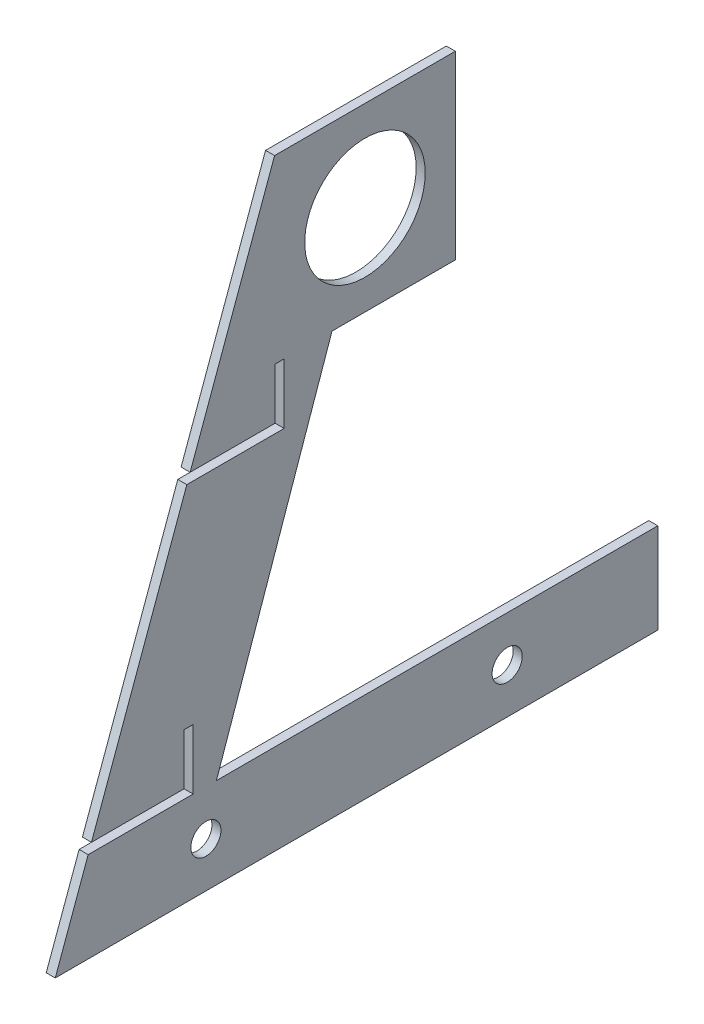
ISO-10303-21;
HEADER;
FILE_DESCRIPTION(('STEP AP214'),'2;1');
FILE_NAME('part.step','',(''),(''),'','','');
FILE_SCHEMA(('AUTOMOTIVE_DESIGN { 1 0 10303 214 1 1 1 1 }'));
ENDSEC;
DATA;
#1=APPLICATION_CONTEXT('core data for automotive mechanical design processes');
#2=APPLICATION_PROTOCOL_DEFINITION('international standard','automotive_design',2000,#1);
#3=PRODUCT_CONTEXT('',#1,'mechanical');
#4=PRODUCT('Part','Part','',(#3));
#5=PRODUCT_RELATED_PRODUCT_CATEGORY('part','',(#4));
#6=PRODUCT_DEFINITION_FORMATION('','',#4);
#7=PRODUCT_DEFINITION_CONTEXT('part definition',#1,'design');
#8=PRODUCT_DEFINITION('design','',#6,#7);
#9=PRODUCT_DEFINITION_SHAPE('','',#8);
#10=(LENGTH_UNIT() NAMED_UNIT(*) SI_UNIT(.MILLI.,.METRE.));
#11=(NAMED_UNIT(*) PLANE_ANGLE_UNIT() SI_UNIT($,.RADIAN.));
#12=(NAMED_UNIT(*) SI_UNIT($,.STERADIAN.) SOLID_ANGLE_UNIT());
#13=UNCERTAINTY_MEASURE_WITH_UNIT(LENGTH_MEASURE(1.E-05),#10,'distance_accuracy_value','');
#14=(GEOMETRIC_REPRESENTATION_CONTEXT(3) GLOBAL_UNCERTAINTY_ASSIGNED_CONTEXT((#13)) GLOBAL_UNIT_ASSIGNED_CONTEXT((#10,
#11,#12)) REPRESENTATION_CONTEXT('',''));
#15=CARTESIAN_POINT('',(0.,0.,0.));
#16=DIRECTION('',(0.,0.,1.));
#17=DIRECTION('',(1.,0.,0.));
#18=AXIS2_PLACEMENT_3D('',#15,#16,#17);
#19=CARTESIAN_POINT('',(3.,-74.4659880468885,-59.5411674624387));
#20=DIRECTION('',(-1.,0.,0.));
#21=DIRECTION('',(0.,0.,1.));
#22=AXIS2_PLACEMENT_3D('',#19,#20,#21);
#23=PLANE('',#22);
#24=CARTESIAN_POINT('',(3.,95.564309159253,37.6647856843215));
#25=DIRECTION('',(1.,0.,0.));
#26=DIRECTION('',(0.,0.,-1.));
#27=AXIS2_PLACEMENT_3D('',#24,#25,#26);
#28=CIRCLE('',#27,20.);
#29=CARTESIAN_POINT('',(3.,95.564309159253,17.6647856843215));
#30=VERTEX_POINT('',#29);
#31=EDGE_CURVE('E390',#30,#30,#28,.T.);
#32=ORIENTED_EDGE('',*,*,#31,.F.);
#33=EDGE_LOOP('',(#32));
#34=FACE_BOUND('',#33,.T.);
#35=DIRECTION('',(0.,1.,0.));
#36=VECTOR('',#35,1.);
#37=CARTESIAN_POINT('',(3.,-44.4659880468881,-59.5411674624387));
#38=LINE('',#37,#36);
#39=CARTESIAN_POINT('',(3.,-74.4659880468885,-59.5411674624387));
#40=VERTEX_POINT('',#39);
#41=CARTESIAN_POINT('',(3.,-44.4659880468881,-59.5411674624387));
#42=VERTEX_POINT('',#41);
#43=EDGE_CURVE('E240',#40,#42,#38,.T.);
#44=ORIENTED_EDGE('',*,*,#43,.T.);
#45=DIRECTION('',(0.,0.,1.));
#46=VECTOR('',#45,1.);
#47=CARTESIAN_POINT('',(3.,-44.4659880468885,86.983641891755));
#48=LINE('',#47,#46);
#49=CARTESIAN_POINT('',(3.,-44.4659880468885,86.983641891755));
#50=VERTEX_POINT('',#49);
#51=EDGE_CURVE('E127',#42,#50,#48,.T.);
#52=ORIENTED_EDGE('',*,*,#51,.T.);
#53=DIRECTION('',(0.,0.944189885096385,-0.329401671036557));
#54=VECTOR('',#53,1.);
#55=CARTESIAN_POINT('',(3.,-44.4659880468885,86.983641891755));
#56=LINE('',#55,#54);
#57=CARTESIAN_POINT('',(3.,65.564309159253,48.5971220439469));
#58=VERTEX_POINT('',#57);
#59=EDGE_CURVE('E291',#50,#58,#56,.T.);
#60=ORIENTED_EDGE('',*,*,#59,.T.);
#61=DIRECTION('',(0.,0.,-1.));
#62=VECTOR('',#61,1.);
#63=CARTESIAN_POINT('',(3.,65.564309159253,7.66478568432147));
#64=LINE('',#63,#62);
#65=CARTESIAN_POINT('',(3.,65.564309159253,7.66478568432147));
#66=VERTEX_POINT('',#65);
#67=EDGE_CURVE('E310',#58,#66,#64,.T.);
#68=ORIENTED_EDGE('',*,*,#67,.T.);
#69=DIRECTION('',(0.,1.,0.));
#70=VECTOR('',#69,1.);
#71=CARTESIAN_POINT('',(3.,125.564309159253,7.66478568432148));
#72=LINE('',#71,#70);
#73=CARTESIAN_POINT('',(3.,125.564309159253,7.66478568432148));
#74=VERTEX_POINT('',#73);
#75=EDGE_CURVE('E307',#66,#74,#72,.T.);
#76=ORIENTED_EDGE('',*,*,#75,.T.);
#77=DIRECTION('',(0.,0.,1.));
#78=VECTOR('',#77,1.);
#79=CARTESIAN_POINT('',(3.,125.564309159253,7.66478568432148));
#80=LINE('',#79,#78);
#81=CARTESIAN_POINT('',(3.,125.564309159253,67.6647856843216));
#82=VERTEX_POINT('',#81);
#83=EDGE_CURVE('E309',#74,#82,#80,.T.);
#84=ORIENTED_EDGE('',*,*,#83,.T.);
#85=DIRECTION('',(0.,-0.939692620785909,0.342020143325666));
#86=VECTOR('',#85,1.);
#87=CARTESIAN_POINT('',(3.,48.5340119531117,95.7015210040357));
#88=LINE('',#87,#86);
#89=CARTESIAN_POINT('',(3.,48.5340119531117,95.7015210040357));
#90=VERTEX_POINT('',#89);
#91=EDGE_CURVE('E312',#82,#90,#88,.T.);
#92=ORIENTED_EDGE('',*,*,#91,.T.);
#93=DIRECTION('',(0.,0.,-1.));
#94=VECTOR('',#93,1.);
#95=CARTESIAN_POINT('',(3.,48.5340119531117,95.7015210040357));
#96=LINE('',#95,#94);
#97=CARTESIAN_POINT('',(3.,48.5340119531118,67.4793200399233));
#98=VERTEX_POINT('',#97);
#99=EDGE_CURVE('E318',#90,#98,#96,.T.);
#100=ORIENTED_EDGE('',*,*,#99,.T.);
#101=DIRECTION('',(0.,1.,0.));
#102=VECTOR('',#101,1.);
#103=CARTESIAN_POINT('',(3.,65.5340119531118,67.4793200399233));
#104=LINE('',#103,#102);
#105=CARTESIAN_POINT('',(3.,65.5340119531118,67.4793200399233));
#106=VERTEX_POINT('',#105);
#107=EDGE_CURVE('E320',#98,#106,#104,.T.);
#108=ORIENTED_EDGE('',*,*,#107,.T.);
#109=DIRECTION('',(0.,0.,-1.));
#110=VECTOR('',#109,1.);
#111=CARTESIAN_POINT('',(3.,65.5340119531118,64.4793200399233));
#112=LINE('',#111,#110);
#113=CARTESIAN_POINT('',(3.,65.5340119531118,64.4793200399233));
#114=VERTEX_POINT('',#113);
#115=EDGE_CURVE('E322',#106,#114,#112,.T.);
#116=ORIENTED_EDGE('',*,*,#115,.T.);
#117=DIRECTION('',(0.,-1.,0.));
#118=VECTOR('',#117,1.);
#119=CARTESIAN_POINT('',(3.,65.5340119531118,64.4793200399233));
#120=LINE('',#119,#118);
#121=CARTESIAN_POINT('',(3.,45.5340119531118,64.4793200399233));
#122=VERTEX_POINT('',#121);
#123=EDGE_CURVE('E324',#114,#122,#120,.T.);
#124=ORIENTED_EDGE('',*,*,#123,.T.);
#125=DIRECTION('',(0.,0.,1.));
#126=VECTOR('',#125,1.);
#127=CARTESIAN_POINT('',(3.,45.5340119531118,64.4793200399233));
#128=LINE('',#127,#126);
#129=CARTESIAN_POINT('',(3.,45.5340119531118,96.7934317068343));
#130=VERTEX_POINT('',#129);
#131=EDGE_CURVE('E326',#122,#130,#128,.T.);
#132=ORIENTED_EDGE('',*,*,#131,.T.);
#133=DIRECTION('',(0.,-0.939692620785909,0.342020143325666));
#134=VECTOR('',#133,1.);
#135=CARTESIAN_POINT('',(3.,-41.4659880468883,128.458842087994));
#136=LINE('',#135,#134);
#137=CARTESIAN_POINT('',(3.,-41.4659880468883,128.458842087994));
#138=VERTEX_POINT('',#137);
#139=EDGE_CURVE('E328',#130,#138,#136,.T.);
#140=ORIENTED_EDGE('',*,*,#139,.T.);
#141=DIRECTION('',(0.,0.,-1.));
#142=VECTOR('',#141,1.);
#143=CARTESIAN_POINT('',(3.,-41.4659880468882,97.6925232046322));
#144=LINE('',#143,#142);
#145=CARTESIAN_POINT('',(3.,-41.4659880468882,97.6925232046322));
#146=VERTEX_POINT('',#145);
#147=EDGE_CURVE('E330',#138,#146,#144,.T.);
#148=ORIENTED_EDGE('',*,*,#147,.T.);
#149=DIRECTION('',(0.,1.,0.));
#150=VECTOR('',#149,1.);
#151=CARTESIAN_POINT('',(3.,-24.4659880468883,97.6925232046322));
#152=LINE('',#151,#150);
#153=CARTESIAN_POINT('',(3.,-24.4659880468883,97.6925232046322));
#154=VERTEX_POINT('',#153);
#155=EDGE_CURVE('E332',#146,#154,#152,.T.);
#156=ORIENTED_EDGE('',*,*,#155,.T.);
#157=DIRECTION('',(0.,0.,-1.));
#158=VECTOR('',#157,1.);
#159=CARTESIAN_POINT('',(3.,-24.4659880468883,94.6925232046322));
#160=LINE('',#159,#158);
#161=CARTESIAN_POINT('',(3.,-24.4659880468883,94.6925232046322));
#162=VERTEX_POINT('',#161);
#163=EDGE_CURVE('E334',#154,#162,#160,.T.);
#164=ORIENTED_EDGE('',*,*,#163,.T.);
#165=DIRECTION('',(0.,-1.,0.));
#166=VECTOR('',#165,1.);
#167=CARTESIAN_POINT('',(3.,-44.4659880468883,94.6925232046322));
#168=LINE('',#167,#166);
#169=CARTESIAN_POINT('',(3.,-44.4659880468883,94.6925232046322));
#170=VERTEX_POINT('',#169);
#171=EDGE_CURVE('E182',#162,#170,#168,.T.);
#172=ORIENTED_EDGE('',*,*,#171,.T.);
#173=DIRECTION('',(0.,0.,1.));
#174=VECTOR('',#173,1.);
#175=CARTESIAN_POINT('',(3.,-44.4659880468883,94.6925232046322));
#176=LINE('',#175,#174);
#177=CARTESIAN_POINT('',(3.,-44.4659880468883,129.550752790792));
#178=VERTEX_POINT('',#177);
#179=EDGE_CURVE('E176',#170,#178,#176,.T.);
#180=ORIENTED_EDGE('',*,*,#179,.T.);
#181=DIRECTION('',(0.,-0.939692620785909,0.342020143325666));
#182=VECTOR('',#181,1.);
#183=CARTESIAN_POINT('',(3.,-74.4356908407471,140.458832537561));
#184=LINE('',#183,#182);
#185=CARTESIAN_POINT('',(3.,-74.4659880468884,140.469859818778));
#186=VERTEX_POINT('',#185);
#187=EDGE_CURVE('E180',#178,#186,#184,.T.);
#188=ORIENTED_EDGE('',*,*,#187,.T.);
#189=DIRECTION('',(0.,0.,-1.));
#190=VECTOR('',#189,1.);
#191=CARTESIAN_POINT('',(3.,-74.4659880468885,-59.5411674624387));
#192=LINE('',#191,#190);
#193=EDGE_CURVE('E49',#186,#40,#192,.T.);
#194=ORIENTED_EDGE('',*,*,#193,.T.);
#195=EDGE_LOOP('',(#44,#52,#60,#68,#76,#84,#92,#100,#108,#116,#124,#132,#140,#148,#156,#164,
#172,#180,#188,#194));
#196=FACE_BOUND('',#195,.T.);
#197=CARTESIAN_POINT('',(3.,-59.4659880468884,-9.54116746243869));
#198=DIRECTION('',(1.,0.,0.));
#199=DIRECTION('',(0.,0.,-1.));
#200=AXIS2_PLACEMENT_3D('',#197,#198,#199);
#201=CIRCLE('',#200,5.);
#202=CARTESIAN_POINT('',(3.,-59.4659880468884,-14.5411674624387));
#203=VERTEX_POINT('',#202);
#204=EDGE_CURVE('E205',#203,#203,#201,.T.);
#205=ORIENTED_EDGE('',*,*,#204,.F.);
#206=EDGE_LOOP('',(#205));
#207=FACE_BOUND('',#206,.T.);
#208=CARTESIAN_POINT('',(3.,-59.4659880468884,90.4588325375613));
#209=DIRECTION('',(1.,0.,0.));
#210=DIRECTION('',(0.,0.,-1.));
#211=AXIS2_PLACEMENT_3D('',#208,#209,#210);
#212=CIRCLE('',#211,5.00000000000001);
#213=CARTESIAN_POINT('',(3.,-59.4659880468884,85.4588325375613));
#214=VERTEX_POINT('',#213);
#215=EDGE_CURVE('E381',#214,#214,#212,.T.);
#216=ORIENTED_EDGE('',*,*,#215,.F.);
#217=EDGE_LOOP('',(#216));
#218=FACE_BOUND('',#217,.T.);
#219=ADVANCED_FACE('F32',(#34,#196,#207,#218),#23,.F.);
#220=CARTESIAN_POINT('',(0.,-74.4659880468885,-59.5411674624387));
#221=DIRECTION('',(-1.,0.,0.));
#222=DIRECTION('',(0.,0.,1.));
#223=AXIS2_PLACEMENT_3D('',#220,#221,#222);
#224=PLANE('',#223);
#225=CARTESIAN_POINT('',(0.,95.564309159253,37.6647856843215));
#226=DIRECTION('',(1.,0.,0.));
#227=DIRECTION('',(0.,0.,-1.));
#228=AXIS2_PLACEMENT_3D('',#225,#226,#227);
#229=CIRCLE('',#228,20.);
#230=CARTESIAN_POINT('',(0.,95.564309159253,17.6647856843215));
#231=VERTEX_POINT('',#230);
#232=EDGE_CURVE('E387',#231,#231,#229,.T.);
#233=ORIENTED_EDGE('',*,*,#232,.T.);
#234=EDGE_LOOP('',(#233));
#235=FACE_BOUND('',#234,.T.);
#236=DIRECTION('',(0.,1.,0.));
#237=VECTOR('',#236,1.);
#238=CARTESIAN_POINT('',(0.,-44.4659880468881,-59.5411674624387));
#239=LINE('',#238,#237);
#240=CARTESIAN_POINT('',(0.,-74.4659880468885,-59.5411674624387));
#241=VERTEX_POINT('',#240);
#242=CARTESIAN_POINT('',(0.,-44.4659880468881,-59.5411674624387));
#243=VERTEX_POINT('',#242);
#244=EDGE_CURVE('E201',#241,#243,#239,.T.);
#245=ORIENTED_EDGE('',*,*,#244,.F.);
#246=DIRECTION('',(0.,0.,-1.));
#247=VECTOR('',#246,1.);
#248=CARTESIAN_POINT('',(0.,-74.4659880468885,-59.5411674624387));
#249=LINE('',#248,#247);
#250=CARTESIAN_POINT('',(0.,-74.4659880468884,140.469859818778));
#251=VERTEX_POINT('',#250);
#252=EDGE_CURVE('E119',#251,#241,#249,.T.);
#253=ORIENTED_EDGE('',*,*,#252,.F.);
#254=DIRECTION('',(0.,-0.939692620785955,0.342020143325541));
#255=VECTOR('',#254,1.);
#256=CARTESIAN_POINT('',(0.,-74.4356908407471,140.458832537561));
#257=LINE('',#256,#255);
#258=CARTESIAN_POINT('',(0.,-44.4659880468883,129.550752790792));
#259=VERTEX_POINT('',#258);
#260=EDGE_CURVE('E113',#259,#251,#257,.T.);
#261=ORIENTED_EDGE('',*,*,#260,.F.);
#262=DIRECTION('',(0.,0.,1.));
#263=VECTOR('',#262,1.);
#264=CARTESIAN_POINT('',(0.,-44.4659880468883,94.6925232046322));
#265=LINE('',#264,#263);
#266=CARTESIAN_POINT('',(0.,-44.4659880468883,94.6925232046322));
#267=VERTEX_POINT('',#266);
#268=EDGE_CURVE('E191',#267,#259,#265,.T.);
#269=ORIENTED_EDGE('',*,*,#268,.F.);
#270=DIRECTION('',(0.,-1.,0.));
#271=VECTOR('',#270,1.);
#272=CARTESIAN_POINT('',(0.,-44.4659880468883,94.6925232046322));
#273=LINE('',#272,#271);
#274=CARTESIAN_POINT('',(0.,-24.4659880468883,94.6925232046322));
#275=VERTEX_POINT('',#274);
#276=EDGE_CURVE('E235',#275,#267,#273,.T.);
#277=ORIENTED_EDGE('',*,*,#276,.F.);
#278=DIRECTION('',(0.,0.,-1.));
#279=VECTOR('',#278,1.);
#280=CARTESIAN_POINT('',(0.,-24.4659880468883,94.6925232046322));
#281=LINE('',#280,#279);
#282=CARTESIAN_POINT('',(0.,-24.4659880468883,97.6925232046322));
#283=VERTEX_POINT('',#282);
#284=EDGE_CURVE('E233',#283,#275,#281,.T.);
#285=ORIENTED_EDGE('',*,*,#284,.F.);
#286=DIRECTION('',(0.,1.,0.));
#287=VECTOR('',#286,1.);
#288=CARTESIAN_POINT('',(0.,-24.4659880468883,97.6925232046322));
#289=LINE('',#288,#287);
#290=CARTESIAN_POINT('',(0.,-41.4659880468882,97.6925232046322));
#291=VERTEX_POINT('',#290);
#292=EDGE_CURVE('E231',#291,#283,#289,.T.);
#293=ORIENTED_EDGE('',*,*,#292,.F.);
#294=DIRECTION('',(0.,0.,-1.));
#295=VECTOR('',#294,1.);
#296=CARTESIAN_POINT('',(0.,-41.4659880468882,97.6925232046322));
#297=LINE('',#296,#295);
#298=CARTESIAN_POINT('',(0.,-41.4659880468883,128.458842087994));
#299=VERTEX_POINT('',#298);
#300=EDGE_CURVE('E229',#299,#291,#297,.T.);
#301=ORIENTED_EDGE('',*,*,#300,.F.);
#302=DIRECTION('',(0.,-0.939692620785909,0.342020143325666));
#303=VECTOR('',#302,1.);
#304=CARTESIAN_POINT('',(0.,-41.4659880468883,128.458842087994));
#305=LINE('',#304,#303);
#306=CARTESIAN_POINT('',(0.,45.5340119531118,96.7934317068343));
#307=VERTEX_POINT('',#306);
#308=EDGE_CURVE('E227',#307,#299,#305,.T.);
#309=ORIENTED_EDGE('',*,*,#308,.F.);
#310=DIRECTION('',(0.,0.,1.));
#311=VECTOR('',#310,1.);
#312=CARTESIAN_POINT('',(0.,45.5340119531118,64.4793200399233));
#313=LINE('',#312,#311);
#314=CARTESIAN_POINT('',(0.,45.5340119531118,64.4793200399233));
#315=VERTEX_POINT('',#314);
#316=EDGE_CURVE('E225',#315,#307,#313,.T.);
#317=ORIENTED_EDGE('',*,*,#316,.F.);
#318=DIRECTION('',(0.,-1.,0.));
#319=VECTOR('',#318,1.);
#320=CARTESIAN_POINT('',(0.,65.5340119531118,64.4793200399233));
#321=LINE('',#320,#319);
#322=CARTESIAN_POINT('',(0.,65.5340119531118,64.4793200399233));
#323=VERTEX_POINT('',#322);
#324=EDGE_CURVE('E223',#323,#315,#321,.T.);
#325=ORIENTED_EDGE('',*,*,#324,.F.);
#326=DIRECTION('',(0.,0.,-1.));
#327=VECTOR('',#326,1.);
#328=CARTESIAN_POINT('',(0.,65.5340119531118,64.4793200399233));
#329=LINE('',#328,#327);
#330=CARTESIAN_POINT('',(0.,65.5340119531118,67.4793200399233));
#331=VERTEX_POINT('',#330);
#332=EDGE_CURVE('E221',#331,#323,#329,.T.);
#333=ORIENTED_EDGE('',*,*,#332,.F.);
#334=DIRECTION('',(0.,1.,0.));
#335=VECTOR('',#334,1.);
#336=CARTESIAN_POINT('',(0.,65.5340119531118,67.4793200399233));
#337=LINE('',#336,#335);
#338=CARTESIAN_POINT('',(0.,48.5340119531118,67.4793200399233));
#339=VERTEX_POINT('',#338);
#340=EDGE_CURVE('E219',#339,#331,#337,.T.);
#341=ORIENTED_EDGE('',*,*,#340,.F.);
#342=DIRECTION('',(0.,0.,-1.));
#343=VECTOR('',#342,1.);
#344=CARTESIAN_POINT('',(0.,48.5340119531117,95.7015210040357));
#345=LINE('',#344,#343);
#346=CARTESIAN_POINT('',(0.,48.5340119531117,95.7015210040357));
#347=VERTEX_POINT('',#346);
#348=EDGE_CURVE('E217',#347,#339,#345,.T.);
#349=ORIENTED_EDGE('',*,*,#348,.F.);
#350=DIRECTION('',(0.,-0.939692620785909,0.342020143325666));
#351=VECTOR('',#350,1.);
#352=CARTESIAN_POINT('',(0.,48.5340119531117,95.7015210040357));
#353=LINE('',#352,#351);
#354=CARTESIAN_POINT('',(0.,125.564309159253,67.6647856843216));
#355=VERTEX_POINT('',#354);
#356=EDGE_CURVE('E215',#355,#347,#353,.T.);
#357=ORIENTED_EDGE('',*,*,#356,.F.);
#358=DIRECTION('',(0.,0.,1.));
#359=VECTOR('',#358,1.);
#360=CARTESIAN_POINT('',(0.,125.564309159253,7.66478568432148));
#361=LINE('',#360,#359);
#362=CARTESIAN_POINT('',(0.,125.564309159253,7.66478568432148));
#363=VERTEX_POINT('',#362);
#364=EDGE_CURVE('E213',#363,#355,#361,.T.);
#365=ORIENTED_EDGE('',*,*,#364,.F.);
#366=DIRECTION('',(0.,1.,0.));
#367=VECTOR('',#366,1.);
#368=CARTESIAN_POINT('',(0.,125.564309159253,7.66478568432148));
#369=LINE('',#368,#367);
#370=CARTESIAN_POINT('',(0.,65.564309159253,7.66478568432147));
#371=VERTEX_POINT('',#370);
#372=EDGE_CURVE('E211',#371,#363,#369,.T.);
#373=ORIENTED_EDGE('',*,*,#372,.F.);
#374=DIRECTION('',(0.,0.,-1.));
#375=VECTOR('',#374,1.);
#376=CARTESIAN_POINT('',(0.,65.564309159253,7.66478568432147));
#377=LINE('',#376,#375);
#378=CARTESIAN_POINT('',(0.,65.564309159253,48.5971220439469));
#379=VERTEX_POINT('',#378);
#380=EDGE_CURVE('E209',#379,#371,#377,.T.);
#381=ORIENTED_EDGE('',*,*,#380,.F.);
#382=DIRECTION('',(0.,0.944189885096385,-0.329401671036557));
#383=VECTOR('',#382,1.);
#384=CARTESIAN_POINT('',(0.,-44.4659880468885,86.983641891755));
#385=LINE('',#384,#383);
#386=CARTESIAN_POINT('',(0.,-44.4659880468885,86.983641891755));
#387=VERTEX_POINT('',#386);
#388=EDGE_CURVE('E207',#387,#379,#385,.T.);
#389=ORIENTED_EDGE('',*,*,#388,.F.);
#390=DIRECTION('',(0.,0.,1.));
#391=VECTOR('',#390,1.);
#392=CARTESIAN_POINT('',(0.,-44.4659880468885,86.983641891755));
#393=LINE('',#392,#391);
#394=EDGE_CURVE('E204',#243,#387,#393,.T.);
#395=ORIENTED_EDGE('',*,*,#394,.F.);
#396=EDGE_LOOP('',(#245,#253,#261,#269,#277,#285,#293,#301,#309,#317,#325,#333,#341,#349,#357,
#365,#373,#381,#389,#395));
#397=FACE_BOUND('',#396,.T.);
#398=CARTESIAN_POINT('',(0.,-59.4659880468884,-9.54116746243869));
#399=DIRECTION('',(1.,0.,0.));
#400=DIRECTION('',(0.,0.,-1.));
#401=AXIS2_PLACEMENT_3D('',#398,#399,#400);
#402=CIRCLE('',#401,5.);
#403=CARTESIAN_POINT('',(0.,-59.4659880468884,-14.5411674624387));
#404=VERTEX_POINT('',#403);
#405=EDGE_CURVE('E393',#404,#404,#402,.T.);
#406=ORIENTED_EDGE('',*,*,#405,.T.);
#407=EDGE_LOOP('',(#406));
#408=FACE_BOUND('',#407,.T.);
#409=CARTESIAN_POINT('',(0.,-59.4659880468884,90.4588325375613));
#410=DIRECTION('',(1.,0.,0.));
#411=DIRECTION('',(0.,0.,-1.));
#412=AXIS2_PLACEMENT_3D('',#409,#410,#411);
#413=CIRCLE('',#412,5.00000000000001);
#414=CARTESIAN_POINT('',(0.,-59.4659880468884,85.4588325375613));
#415=VERTEX_POINT('',#414);
#416=EDGE_CURVE('E384',#415,#415,#413,.T.);
#417=ORIENTED_EDGE('',*,*,#416,.T.);
#418=EDGE_LOOP('',(#417));
#419=FACE_BOUND('',#418,.T.);
#420=ADVANCED_FACE('F295',(#235,#397,#408,#419),#224,.T.);
#421=CARTESIAN_POINT('',(3.,-44.4659880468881,-59.5411674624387));
#422=DIRECTION('',(0.,0.,1.));
#423=DIRECTION('',(1.,0.,0.));
#424=AXIS2_PLACEMENT_3D('',#421,#422,#423);
#425=PLANE('',#424);
#426=ORIENTED_EDGE('',*,*,#244,.T.);
#427=DIRECTION('',(-1.,0.,0.));
#428=VECTOR('',#427,1.);
#429=CARTESIAN_POINT('',(3.,-44.4659880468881,-59.5411674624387));
#430=LINE('',#429,#428);
#431=EDGE_CURVE('E11',#42,#243,#430,.T.);
#432=ORIENTED_EDGE('',*,*,#431,.F.);
#433=ORIENTED_EDGE('',*,*,#43,.F.);
#434=DIRECTION('',(-1.,0.,0.));
#435=VECTOR('',#434,1.);
#436=CARTESIAN_POINT('',(3.,-74.4659880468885,-59.5411674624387));
#437=LINE('',#436,#435);
#438=EDGE_CURVE('E197',#40,#241,#437,.T.);
#439=ORIENTED_EDGE('',*,*,#438,.T.);
#440=EDGE_LOOP('',(#426,#432,#433,#439));
#441=FACE_BOUND('',#440,.T.);
#442=ADVANCED_FACE('F34',(#441),#425,.F.);
#443=CARTESIAN_POINT('',(3.,-44.4659880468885,86.983641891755));
#444=DIRECTION('',(0.,-1.,0.));
#445=DIRECTION('',(0.,0.,-1.));
#446=AXIS2_PLACEMENT_3D('',#443,#444,#445);
#447=PLANE('',#446);
#448=ORIENTED_EDGE('',*,*,#394,.T.);
#449=DIRECTION('',(-1.,0.,0.));
#450=VECTOR('',#449,1.);
#451=CARTESIAN_POINT('',(3.,-44.4659880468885,86.983641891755));
#452=LINE('',#451,#450);
#453=EDGE_CURVE('E41',#50,#387,#452,.T.);
#454=ORIENTED_EDGE('',*,*,#453,.F.);
#455=ORIENTED_EDGE('',*,*,#51,.F.);
#456=ORIENTED_EDGE('',*,*,#431,.T.);
#457=EDGE_LOOP('',(#448,#454,#455,#456));
#458=FACE_BOUND('',#457,.T.);
#459=ADVANCED_FACE('F575',(#458),#447,.F.);
#460=CARTESIAN_POINT('',(3.,-44.4659880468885,86.983641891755));
#461=DIRECTION('',(0.,0.329401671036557,0.944189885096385));
#462=DIRECTION('',(0.,-0.944189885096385,0.329401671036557));
#463=AXIS2_PLACEMENT_3D('',#460,#461,#462);
#464=PLANE('',#463);
#465=ORIENTED_EDGE('',*,*,#388,.T.);
#466=DIRECTION('',(-1.,0.,0.));
#467=VECTOR('',#466,1.);
#468=CARTESIAN_POINT('',(3.,65.564309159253,48.5971220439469));
#469=LINE('',#468,#467);
#470=EDGE_CURVE('E283',#58,#379,#469,.T.);
#471=ORIENTED_EDGE('',*,*,#470,.F.);
#472=ORIENTED_EDGE('',*,*,#59,.F.);
#473=ORIENTED_EDGE('',*,*,#453,.T.);
#474=EDGE_LOOP('',(#465,#471,#472,#473));
#475=FACE_BOUND('',#474,.T.);
#476=ADVANCED_FACE('F289',(#475),#464,.F.);
#477=CARTESIAN_POINT('',(3.,65.564309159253,7.66478568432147));
#478=DIRECTION('',(0.,1.,0.));
#479=DIRECTION('',(0.,0.,1.));
#480=AXIS2_PLACEMENT_3D('',#477,#478,#479);
#481=PLANE('',#480);
#482=ORIENTED_EDGE('',*,*,#380,.T.);
#483=DIRECTION('',(-1.,0.,0.));
#484=VECTOR('',#483,1.);
#485=CARTESIAN_POINT('',(3.,65.564309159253,7.66478568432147));
#486=LINE('',#485,#484);
#487=EDGE_CURVE('E280',#66,#371,#486,.T.);
#488=ORIENTED_EDGE('',*,*,#487,.F.);
#489=ORIENTED_EDGE('',*,*,#67,.F.);
#490=ORIENTED_EDGE('',*,*,#470,.T.);
#491=EDGE_LOOP('',(#482,#488,#489,#490));
#492=FACE_BOUND('',#491,.T.);
#493=ADVANCED_FACE('F301',(#492),#481,.F.);
#494=CARTESIAN_POINT('',(3.,125.564309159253,7.66478568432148));
#495=DIRECTION('',(0.,0.,1.));
#496=DIRECTION('',(0.,-1.,0.));
#497=AXIS2_PLACEMENT_3D('',#494,#495,#496);
#498=PLANE('',#497);
#499=ORIENTED_EDGE('',*,*,#372,.T.);
#500=DIRECTION('',(-1.,0.,0.));
#501=VECTOR('',#500,1.);
#502=CARTESIAN_POINT('',(3.,125.564309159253,7.66478568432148));
#503=LINE('',#502,#501);
#504=EDGE_CURVE('E277',#74,#363,#503,.T.);
#505=ORIENTED_EDGE('',*,*,#504,.F.);
#506=ORIENTED_EDGE('',*,*,#75,.F.);
#507=ORIENTED_EDGE('',*,*,#487,.T.);
#508=EDGE_LOOP('',(#499,#505,#506,#507));
#509=FACE_BOUND('',#508,.T.);
#510=ADVANCED_FACE('F305',(#509),#498,.F.);
#511=CARTESIAN_POINT('',(3.,125.564309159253,7.66478568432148));
#512=DIRECTION('',(0.,-1.,0.));
#513=DIRECTION('',(0.,0.,-1.));
#514=AXIS2_PLACEMENT_3D('',#511,#512,#513);
#515=PLANE('',#514);
#516=ORIENTED_EDGE('',*,*,#364,.T.);
#517=DIRECTION('',(-1.,0.,0.));
#518=VECTOR('',#517,1.);
#519=CARTESIAN_POINT('',(3.,125.564309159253,67.6647856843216));
#520=LINE('',#519,#518);
#521=EDGE_CURVE('E274',#82,#355,#520,.T.);
#522=ORIENTED_EDGE('',*,*,#521,.F.);
#523=ORIENTED_EDGE('',*,*,#83,.F.);
#524=ORIENTED_EDGE('',*,*,#504,.T.);
#525=EDGE_LOOP('',(#516,#522,#523,#524));
#526=FACE_BOUND('',#525,.T.);
#527=ADVANCED_FACE('F540',(#526),#515,.F.);
#528=CARTESIAN_POINT('',(3.,48.5340119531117,95.7015210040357));
#529=DIRECTION('',(0.,-0.342020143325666,-0.939692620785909));
#530=DIRECTION('',(0.,0.939692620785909,-0.342020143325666));
#531=AXIS2_PLACEMENT_3D('',#528,#529,#530);
#532=PLANE('',#531);
#533=ORIENTED_EDGE('',*,*,#356,.T.);
#534=DIRECTION('',(-1.,0.,0.));
#535=VECTOR('',#534,1.);
#536=CARTESIAN_POINT('',(3.,48.5340119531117,95.7015210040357));
#537=LINE('',#536,#535);
#538=EDGE_CURVE('E271',#90,#347,#537,.T.);
#539=ORIENTED_EDGE('',*,*,#538,.F.);
#540=ORIENTED_EDGE('',*,*,#91,.F.);
#541=ORIENTED_EDGE('',*,*,#521,.T.);
#542=EDGE_LOOP('',(#533,#539,#540,#541));
#543=FACE_BOUND('',#542,.T.);
#544=ADVANCED_FACE('F530',(#543),#532,.F.);
#545=CARTESIAN_POINT('',(3.,48.5340119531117,95.7015210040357));
#546=DIRECTION('',(0.,1.,0.));
#547=DIRECTION('',(0.,0.,1.));
#548=AXIS2_PLACEMENT_3D('',#545,#546,#547);
#549=PLANE('',#548);
#550=ORIENTED_EDGE('',*,*,#348,.T.);
#551=DIRECTION('',(-1.,0.,0.));
#552=VECTOR('',#551,1.);
#553=CARTESIAN_POINT('',(3.,48.5340119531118,67.4793200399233));
#554=LINE('',#553,#552);
#555=EDGE_CURVE('E268',#98,#339,#554,.T.);
#556=ORIENTED_EDGE('',*,*,#555,.F.);
#557=ORIENTED_EDGE('',*,*,#99,.F.);
#558=ORIENTED_EDGE('',*,*,#538,.T.);
#559=EDGE_LOOP('',(#550,#556,#557,#558));
#560=FACE_BOUND('',#559,.T.);
#561=ADVANCED_FACE('F520',(#560),#549,.F.);
#562=CARTESIAN_POINT('',(3.,65.5340119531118,67.4793200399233));
#563=DIRECTION('',(0.,0.,1.));
#564=DIRECTION('',(1.,0.,0.));
#565=AXIS2_PLACEMENT_3D('',#562,#563,#564);
#566=PLANE('',#565);
#567=ORIENTED_EDGE('',*,*,#340,.T.);
#568=DIRECTION('',(-1.,0.,0.));
#569=VECTOR('',#568,1.);
#570=CARTESIAN_POINT('',(3.,65.5340119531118,67.4793200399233));
#571=LINE('',#570,#569);
#572=EDGE_CURVE('E265',#106,#331,#571,.T.);
#573=ORIENTED_EDGE('',*,*,#572,.F.);
#574=ORIENTED_EDGE('',*,*,#107,.F.);
#575=ORIENTED_EDGE('',*,*,#555,.T.);
#576=EDGE_LOOP('',(#567,#573,#574,#575));
#577=FACE_BOUND('',#576,.T.);
#578=ADVANCED_FACE('F510',(#577),#566,.F.);
#579=CARTESIAN_POINT('',(3.,65.5340119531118,64.4793200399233));
#580=DIRECTION('',(0.,1.,0.));
#581=DIRECTION('',(0.,0.,1.));
#582=AXIS2_PLACEMENT_3D('',#579,#580,#581);
#583=PLANE('',#582);
#584=ORIENTED_EDGE('',*,*,#332,.T.);
#585=DIRECTION('',(-1.,0.,0.));
#586=VECTOR('',#585,1.);
#587=CARTESIAN_POINT('',(3.,65.5340119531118,64.4793200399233));
#588=LINE('',#587,#586);
#589=EDGE_CURVE('E262',#114,#323,#588,.T.);
#590=ORIENTED_EDGE('',*,*,#589,.F.);
#591=ORIENTED_EDGE('',*,*,#115,.F.);
#592=ORIENTED_EDGE('',*,*,#572,.T.);
#593=EDGE_LOOP('',(#584,#590,#591,#592));
#594=FACE_BOUND('',#593,.T.);
#595=ADVANCED_FACE('F500',(#594),#583,.F.);
#596=CARTESIAN_POINT('',(3.,65.5340119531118,64.4793200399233));
#597=DIRECTION('',(0.,0.,-1.));
#598=DIRECTION('',(-1.,0.,0.));
#599=AXIS2_PLACEMENT_3D('',#596,#597,#598);
#600=PLANE('',#599);
#601=ORIENTED_EDGE('',*,*,#324,.T.);
#602=DIRECTION('',(-1.,0.,0.));
#603=VECTOR('',#602,1.);
#604=CARTESIAN_POINT('',(3.,45.5340119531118,64.4793200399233));
#605=LINE('',#604,#603);
#606=EDGE_CURVE('E259',#122,#315,#605,.T.);
#607=ORIENTED_EDGE('',*,*,#606,.F.);
#608=ORIENTED_EDGE('',*,*,#123,.F.);
#609=ORIENTED_EDGE('',*,*,#589,.T.);
#610=EDGE_LOOP('',(#601,#607,#608,#609));
#611=FACE_BOUND('',#610,.T.);
#612=ADVANCED_FACE('F490',(#611),#600,.F.);
#613=CARTESIAN_POINT('',(3.,45.5340119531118,64.4793200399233));
#614=DIRECTION('',(0.,-1.,0.));
#615=DIRECTION('',(0.,0.,-1.));
#616=AXIS2_PLACEMENT_3D('',#613,#614,#615);
#617=PLANE('',#616);
#618=ORIENTED_EDGE('',*,*,#316,.T.);
#619=DIRECTION('',(-1.,0.,0.));
#620=VECTOR('',#619,1.);
#621=CARTESIAN_POINT('',(3.,45.5340119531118,96.7934317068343));
#622=LINE('',#621,#620);
#623=EDGE_CURVE('E256',#130,#307,#622,.T.);
#624=ORIENTED_EDGE('',*,*,#623,.F.);
#625=ORIENTED_EDGE('',*,*,#131,.F.);
#626=ORIENTED_EDGE('',*,*,#606,.T.);
#627=EDGE_LOOP('',(#618,#624,#625,#626));
#628=FACE_BOUND('',#627,.T.);
#629=ADVANCED_FACE('F480',(#628),#617,.F.);
#630=CARTESIAN_POINT('',(3.,-41.4659880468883,128.458842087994));
#631=DIRECTION('',(0.,-0.342020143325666,-0.93969262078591));
#632=DIRECTION('',(0.,0.93969262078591,-0.342020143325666));
#633=AXIS2_PLACEMENT_3D('',#630,#631,#632);
#634=PLANE('',#633);
#635=ORIENTED_EDGE('',*,*,#308,.T.);
#636=DIRECTION('',(-1.,0.,0.));
#637=VECTOR('',#636,1.);
#638=CARTESIAN_POINT('',(3.,-41.4659880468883,128.458842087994));
#639=LINE('',#638,#637);
#640=EDGE_CURVE('E253',#138,#299,#639,.T.);
#641=ORIENTED_EDGE('',*,*,#640,.F.);
#642=ORIENTED_EDGE('',*,*,#139,.F.);
#643=ORIENTED_EDGE('',*,*,#623,.T.);
#644=EDGE_LOOP('',(#635,#641,#642,#643));
#645=FACE_BOUND('',#644,.T.);
#646=ADVANCED_FACE('F470',(#645),#634,.F.);
#647=CARTESIAN_POINT('',(3.,-41.4659880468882,97.6925232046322));
#648=DIRECTION('',(0.,1.,0.));
#649=DIRECTION('',(0.,0.,1.));
#650=AXIS2_PLACEMENT_3D('',#647,#648,#649);
#651=PLANE('',#650);
#652=ORIENTED_EDGE('',*,*,#300,.T.);
#653=DIRECTION('',(-1.,0.,0.));
#654=VECTOR('',#653,1.);
#655=CARTESIAN_POINT('',(3.,-41.4659880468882,97.6925232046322));
#656=LINE('',#655,#654);
#657=EDGE_CURVE('E250',#146,#291,#656,.T.);
#658=ORIENTED_EDGE('',*,*,#657,.F.);
#659=ORIENTED_EDGE('',*,*,#147,.F.);
#660=ORIENTED_EDGE('',*,*,#640,.T.);
#661=EDGE_LOOP('',(#652,#658,#659,#660));
#662=FACE_BOUND('',#661,.T.);
#663=ADVANCED_FACE('F460',(#662),#651,.F.);
#664=CARTESIAN_POINT('',(3.,-24.4659880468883,97.6925232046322));
#665=DIRECTION('',(0.,0.,1.));
#666=DIRECTION('',(1.,0.,0.));
#667=AXIS2_PLACEMENT_3D('',#664,#665,#666);
#668=PLANE('',#667);
#669=ORIENTED_EDGE('',*,*,#292,.T.);
#670=DIRECTION('',(-1.,0.,0.));
#671=VECTOR('',#670,1.);
#672=CARTESIAN_POINT('',(3.,-24.4659880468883,97.6925232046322));
#673=LINE('',#672,#671);
#674=EDGE_CURVE('E247',#154,#283,#673,.T.);
#675=ORIENTED_EDGE('',*,*,#674,.F.);
#676=ORIENTED_EDGE('',*,*,#155,.F.);
#677=ORIENTED_EDGE('',*,*,#657,.T.);
#678=EDGE_LOOP('',(#669,#675,#676,#677));
#679=FACE_BOUND('',#678,.T.);
#680=ADVANCED_FACE('F451',(#679),#668,.F.);
#681=CARTESIAN_POINT('',(3.,-24.4659880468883,94.6925232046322));
#682=DIRECTION('',(0.,1.,0.));
#683=DIRECTION('',(0.,0.,1.));
#684=AXIS2_PLACEMENT_3D('',#681,#682,#683);
#685=PLANE('',#684);
#686=ORIENTED_EDGE('',*,*,#284,.T.);
#687=DIRECTION('',(-1.,0.,0.));
#688=VECTOR('',#687,1.);
#689=CARTESIAN_POINT('',(3.,-24.4659880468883,94.6925232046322));
#690=LINE('',#689,#688);
#691=EDGE_CURVE('E244',#162,#275,#690,.T.);
#692=ORIENTED_EDGE('',*,*,#691,.F.);
#693=ORIENTED_EDGE('',*,*,#163,.F.);
#694=ORIENTED_EDGE('',*,*,#674,.T.);
#695=EDGE_LOOP('',(#686,#692,#693,#694));
#696=FACE_BOUND('',#695,.T.);
#697=ADVANCED_FACE('F340',(#696),#685,.F.);
#698=CARTESIAN_POINT('',(3.,-44.4659880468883,94.6925232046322));
#699=DIRECTION('',(0.,0.,-1.));
#700=DIRECTION('',(-1.,0.,0.));
#701=AXIS2_PLACEMENT_3D('',#698,#699,#700);
#702=PLANE('',#701);
#703=ORIENTED_EDGE('',*,*,#276,.T.);
#704=DIRECTION('',(-1.,0.,0.));
#705=VECTOR('',#704,1.);
#706=CARTESIAN_POINT('',(3.,-44.4659880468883,94.6925232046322));
#707=LINE('',#706,#705);
#708=EDGE_CURVE('E192',#170,#267,#707,.T.);
#709=ORIENTED_EDGE('',*,*,#708,.F.);
#710=ORIENTED_EDGE('',*,*,#171,.F.);
#711=ORIENTED_EDGE('',*,*,#691,.T.);
#712=EDGE_LOOP('',(#703,#709,#710,#711));
#713=FACE_BOUND('',#712,.T.);
#714=ADVANCED_FACE('F344',(#713),#702,.F.);
#715=CARTESIAN_POINT('',(3.,-44.4659880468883,94.6925232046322));
#716=DIRECTION('',(0.,-1.,0.));
#717=DIRECTION('',(0.,0.,-1.));
#718=AXIS2_PLACEMENT_3D('',#715,#716,#717);
#719=PLANE('',#718);
#720=ORIENTED_EDGE('',*,*,#268,.T.);
#721=DIRECTION('',(-1.,0.,0.));
#722=VECTOR('',#721,1.);
#723=CARTESIAN_POINT('',(3.,-44.4659880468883,129.550752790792));
#724=LINE('',#723,#722);
#725=EDGE_CURVE('E188',#178,#259,#724,.T.);
#726=ORIENTED_EDGE('',*,*,#725,.F.);
#727=ORIENTED_EDGE('',*,*,#179,.F.);
#728=ORIENTED_EDGE('',*,*,#708,.T.);
#729=EDGE_LOOP('',(#720,#726,#727,#728));
#730=FACE_BOUND('',#729,.T.);
#731=ADVANCED_FACE('F189',(#730),#719,.F.);
#732=CARTESIAN_POINT('',(3.,-74.4356908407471,140.458832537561));
#733=DIRECTION('',(0.,-0.342020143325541,-0.939692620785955));
#734=DIRECTION('',(0.,0.939692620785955,-0.342020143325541));
#735=AXIS2_PLACEMENT_3D('',#732,#733,#734);
#736=PLANE('',#735);
#737=ORIENTED_EDGE('',*,*,#260,.T.);
#738=DIRECTION('',(-1.,0.,0.));
#739=VECTOR('',#738,1.);
#740=CARTESIAN_POINT('',(3.,-74.4659880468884,140.469859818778));
#741=LINE('',#740,#739);
#742=EDGE_CURVE('E193',#186,#251,#741,.T.);
#743=ORIENTED_EDGE('',*,*,#742,.F.);
#744=ORIENTED_EDGE('',*,*,#187,.F.);
#745=ORIENTED_EDGE('',*,*,#725,.T.);
#746=EDGE_LOOP('',(#737,#743,#744,#745));
#747=FACE_BOUND('',#746,.T.);
#748=ADVANCED_FACE('F195',(#747),#736,.F.);
#749=CARTESIAN_POINT('',(3.,-74.4659880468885,-59.5411674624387));
#750=DIRECTION('',(0.,1.,0.));
#751=DIRECTION('',(0.,0.,1.));
#752=AXIS2_PLACEMENT_3D('',#749,#750,#751);
#753=PLANE('',#752);
#754=ORIENTED_EDGE('',*,*,#252,.T.);
#755=ORIENTED_EDGE('',*,*,#438,.F.);
#756=ORIENTED_EDGE('',*,*,#193,.F.);
#757=ORIENTED_EDGE('',*,*,#742,.T.);
#758=EDGE_LOOP('',(#754,#755,#756,#757));
#759=FACE_BOUND('',#758,.T.);
#760=ADVANCED_FACE('F348',(#759),#753,.F.);
#761=CARTESIAN_POINT('',(3.,-59.4659880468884,-9.54116746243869));
#762=DIRECTION('',(-1.,0.,0.));
#763=DIRECTION('',(0.,0.,1.));
#764=AXIS2_PLACEMENT_3D('',#761,#762,#763);
#765=CYLINDRICAL_SURFACE('',#764,5.);
#766=ORIENTED_EDGE('',*,*,#204,.T.);
#767=EDGE_LOOP('',(#766));
#768=FACE_BOUND('',#767,.T.);
#769=ORIENTED_EDGE('',*,*,#405,.F.);
#770=EDGE_LOOP('',(#769));
#771=FACE_BOUND('',#770,.T.);
#772=ADVANCED_FACE('F350',(#768,#771),#765,.F.);
#773=CARTESIAN_POINT('',(3.,95.564309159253,37.6647856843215));
#774=DIRECTION('',(-1.,0.,0.));
#775=DIRECTION('',(0.,0.,1.));
#776=AXIS2_PLACEMENT_3D('',#773,#774,#775);
#777=CYLINDRICAL_SURFACE('',#776,20.);
#778=ORIENTED_EDGE('',*,*,#31,.T.);
#779=EDGE_LOOP('',(#778));
#780=FACE_BOUND('',#779,.T.);
#781=ORIENTED_EDGE('',*,*,#232,.F.);
#782=EDGE_LOOP('',(#781));
#783=FACE_BOUND('',#782,.T.);
#784=ADVANCED_FACE('F356',(#780,#783),#777,.F.);
#785=CARTESIAN_POINT('',(3.,-59.4659880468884,90.4588325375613));
#786=DIRECTION('',(-1.,0.,0.));
#787=DIRECTION('',(0.,0.,1.));
#788=AXIS2_PLACEMENT_3D('',#785,#786,#787);
#789=CYLINDRICAL_SURFACE('',#788,5.00000000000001);
#790=ORIENTED_EDGE('',*,*,#215,.T.);
#791=EDGE_LOOP('',(#790));
#792=FACE_BOUND('',#791,.T.);
#793=ORIENTED_EDGE('',*,*,#416,.F.);
#794=EDGE_LOOP('',(#793));
#795=FACE_BOUND('',#794,.T.);
#796=ADVANCED_FACE('F372',(#792,#795),#789,.F.);
#797=CLOSED_SHELL('',(#219,#420,#442,#459,#476,#493,#510,#527,#544,#561,#578,#595,#612,#629,
#646,#663,#680,#697,#714,#731,#748,#760,#772,#784,#796));
#798=MANIFOLD_SOLID_BREP('B2',#797);
#799=ADVANCED_BREP_SHAPE_REPRESENTATION('',(#18,#798),#14);
#800=SHAPE_DEFINITION_REPRESENTATION(#9,#799);
ENDSEC;
END-ISO-10303-21;
